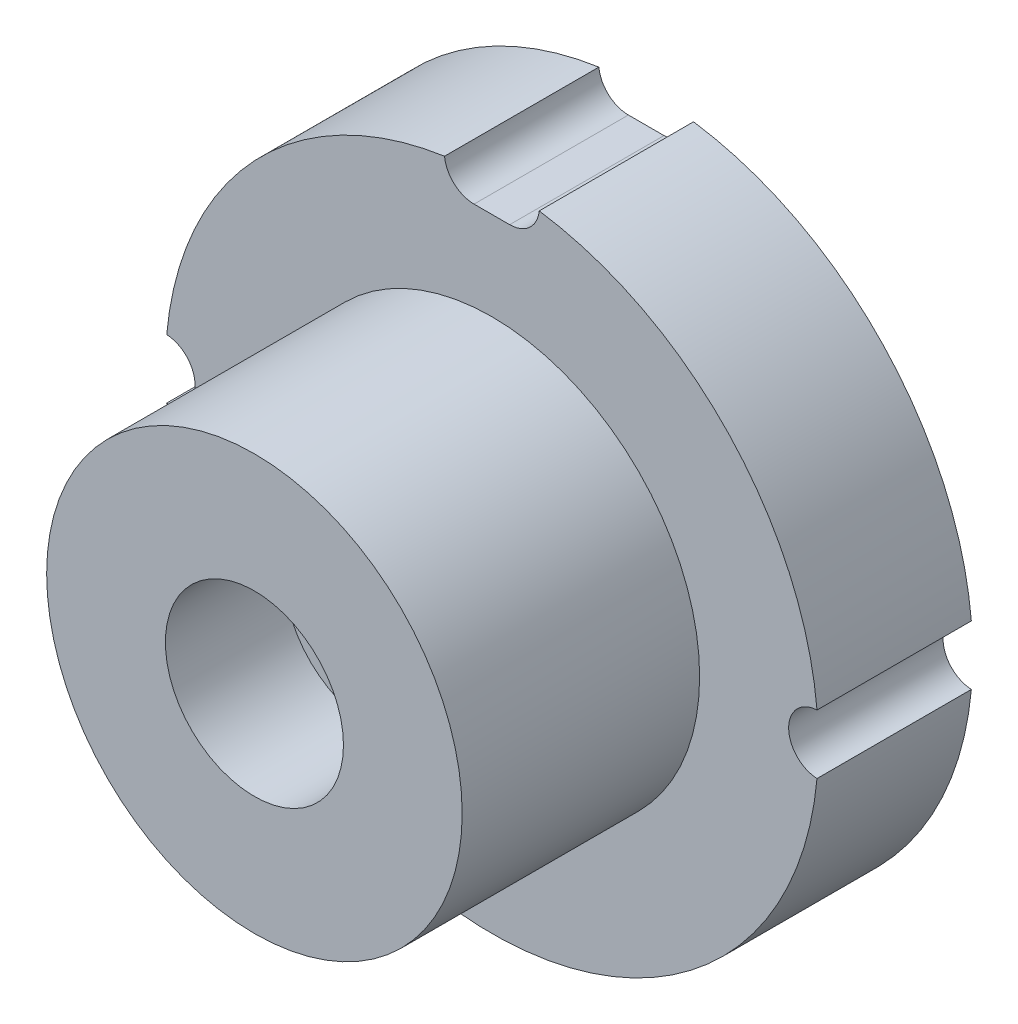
from build123d import *

# Parameters (mm, degrees)
ESQUISSE1_R             = 2.75
EXTRUSION1_DEPTH        = 1.3
ESQUISSE2_R             = 1.75
EXTRUSION2_DEPTH        = 2
ESQUISSE3_R             = 0.75
ENL_V_MAT_EXTRU_1_DEPTH = 1
ESQUISSE4_R             = 0.25
ENL_V_MAT_EXTRU_2_DEPTH = 6.100490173
ESQUISSE5_R             = 0.5
ENL_V_MAT_EXTRU_3_DEPTH = 1


with BuildPart() as part:
    # Esquisse1 → Extrusion1 (new body)
    with BuildSketch(Plane.XY):
        Circle(ESQUISSE1_R)
    extrude(amount=EXTRUSION1_DEPTH)

    # Esquisse2 → Extrusion2 (add)
    with BuildSketch(Plane.XY.offset(1.3)):
        Circle(ESQUISSE2_R)
    extrude(amount=EXTRUSION2_DEPTH)

    # Esquisse3 → Enl_v. mat.-Extru.1 (cut)
    with BuildSketch(Plane.XY.offset(3.3)):
        Circle(ESQUISSE3_R)
    extrude(amount=-ENL_V_MAT_EXTRU_1_DEPTH, mode=Mode.SUBTRACT)

    # Esquisse4 → Enl_v. mat.-Extru.2 (cut, through all)
    with BuildSketch(Plane(origin=(0, 0, 0), x_dir=(-1, 0, 0), z_dir=(0, 0, -1))):
        with Locations((-2.75, 0)):
            Circle(ESQUISSE4_R)
        with Locations((2.75, 0)):
            Circle(ESQUISSE4_R)
        with BuildLine():
            Line((-0.15, 2.495906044), (0.15, 2.495906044))
            ThreePointArc((0.15, 2.495906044), (0.387170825, 2.824962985), (0, 2.945906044))
            ThreePointArc((0, 2.945906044), (-0.387170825, 2.824962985), (-0.15, 2.495906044))
        make_face()
    extrude(amount=-ENL_V_MAT_EXTRU_2_DEPTH, mode=Mode.SUBTRACT)

    # Esquisse5 → Enl_v. mat.-Extru.3 (cut)
    with BuildSketch(Plane(origin=(0, 0, 0), x_dir=(-1, 0, 0), z_dir=(0, 0, -1))):
        with Locations((-1, 0)):
            Circle(ESQUISSE5_R)
        with Locations((1, 0)):
            Circle(ESQUISSE5_R)
        with Locations((0, 1)):
            Circle(ESQUISSE5_R)
    extrude(amount=-ENL_V_MAT_EXTRU_3_DEPTH, mode=Mode.SUBTRACT)


solid = part.part
